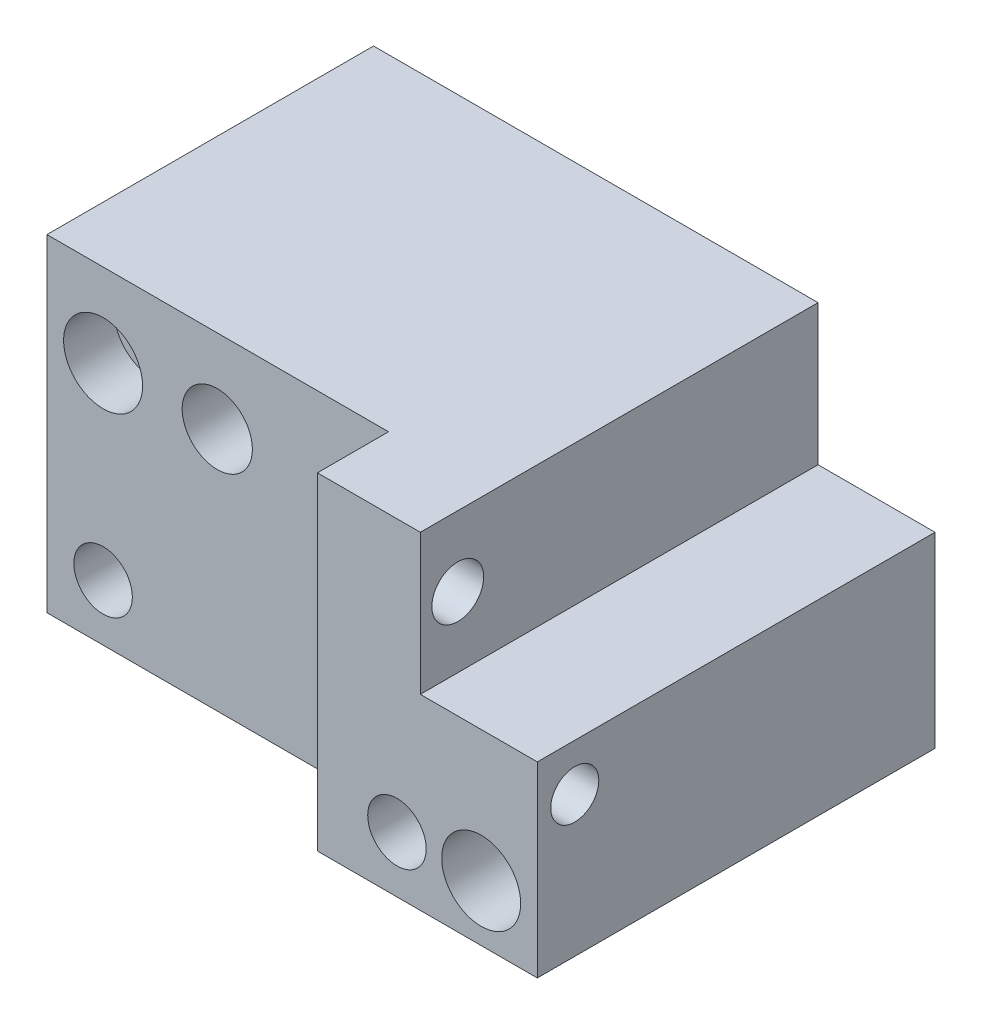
ISO-10303-21;
HEADER;
FILE_DESCRIPTION(('STEP AP214'),'2;1');
FILE_NAME('part.step','',(''),(''),'','','');
FILE_SCHEMA(('AUTOMOTIVE_DESIGN { 1 0 10303 214 1 1 1 1 }'));
ENDSEC;
DATA;
#1=APPLICATION_CONTEXT('core data for automotive mechanical design processes');
#2=APPLICATION_PROTOCOL_DEFINITION('international standard','automotive_design',2000,#1);
#3=PRODUCT_CONTEXT('',#1,'mechanical');
#4=PRODUCT('Part','Part','',(#3));
#5=PRODUCT_RELATED_PRODUCT_CATEGORY('part','',(#4));
#6=PRODUCT_DEFINITION_FORMATION('','',#4);
#7=PRODUCT_DEFINITION_CONTEXT('part definition',#1,'design');
#8=PRODUCT_DEFINITION('design','',#6,#7);
#9=PRODUCT_DEFINITION_SHAPE('','',#8);
#10=(LENGTH_UNIT() NAMED_UNIT(*) SI_UNIT(.MILLI.,.METRE.));
#11=(NAMED_UNIT(*) PLANE_ANGLE_UNIT() SI_UNIT($,.RADIAN.));
#12=(NAMED_UNIT(*) SI_UNIT($,.STERADIAN.) SOLID_ANGLE_UNIT());
#13=UNCERTAINTY_MEASURE_WITH_UNIT(LENGTH_MEASURE(1.E-05),#10,'distance_accuracy_value','');
#14=(GEOMETRIC_REPRESENTATION_CONTEXT(3) GLOBAL_UNCERTAINTY_ASSIGNED_CONTEXT((#13)) GLOBAL_UNIT_ASSIGNED_CONTEXT((#10,
#11,#12)) REPRESENTATION_CONTEXT('',''));
#15=CARTESIAN_POINT('',(0.,0.,0.));
#16=DIRECTION('',(0.,0.,1.));
#17=DIRECTION('',(1.,0.,0.));
#18=AXIS2_PLACEMENT_3D('',#15,#16,#17);
#19=CARTESIAN_POINT('',(0.,0.,-12.7));
#20=DIRECTION('',(0.,0.,-1.));
#21=DIRECTION('',(-1.,0.,0.));
#22=AXIS2_PLACEMENT_3D('',#19,#20,#21);
#23=PLANE('',#22);
#24=CARTESIAN_POINT('',(-146.05,78.74,-12.7));
#25=DIRECTION('',(0.,0.,-1.));
#26=DIRECTION('',(-1.,0.,0.));
#27=AXIS2_PLACEMENT_3D('',#24,#25,#26);
#28=CIRCLE('',#27,3.96875);
#29=CARTESIAN_POINT('',(-150.01875,78.74,-12.7));
#30=VERTEX_POINT('',#29);
#31=EDGE_CURVE('E157',#30,#30,#28,.T.);
#32=ORIENTED_EDGE('',*,*,#31,.F.);
#33=EDGE_LOOP('',(#32));
#34=FACE_BOUND('',#33,.T.);
#35=CARTESIAN_POINT('',(-195.58,78.74,-12.7));
#36=DIRECTION('',(0.,0.,-1.));
#37=DIRECTION('',(-1.,0.,0.));
#38=AXIS2_PLACEMENT_3D('',#35,#36,#37);
#39=CIRCLE('',#38,3.96875);
#40=CARTESIAN_POINT('',(-199.54875,78.74,-12.7));
#41=VERTEX_POINT('',#40);
#42=EDGE_CURVE('E161',#41,#41,#39,.T.);
#43=ORIENTED_EDGE('',*,*,#42,.F.);
#44=EDGE_LOOP('',(#43));
#45=FACE_BOUND('',#44,.T.);
#46=CARTESIAN_POINT('',(-195.58,104.267,-12.7));
#47=DIRECTION('',(0.,0.,-1.));
#48=DIRECTION('',(-1.,0.,0.));
#49=AXIS2_PLACEMENT_3D('',#46,#47,#48);
#50=CIRCLE('',#49,3.5687);
#51=CARTESIAN_POINT('',(-199.1487,104.267,-12.7));
#52=VERTEX_POINT('',#51);
#53=EDGE_CURVE('E167',#52,#52,#50,.F.);
#54=ORIENTED_EDGE('',*,*,#53,.T.);
#55=EDGE_LOOP('',(#54));
#56=FACE_BOUND('',#55,.T.);
#57=CARTESIAN_POINT('',(-180.086,104.267,-12.7));
#58=DIRECTION('',(0.,0.,-1.));
#59=DIRECTION('',(-1.,0.,0.));
#60=AXIS2_PLACEMENT_3D('',#57,#58,#59);
#61=CIRCLE('',#60,4.7625);
#62=CARTESIAN_POINT('',(-184.8485,104.267,-12.7));
#63=VERTEX_POINT('',#62);
#64=EDGE_CURVE('E173',#63,#63,#61,.F.);
#65=ORIENTED_EDGE('',*,*,#64,.T.);
#66=EDGE_LOOP('',(#65));
#67=FACE_BOUND('',#66,.T.);
#68=DIRECTION('',(1.,0.,0.));
#69=VECTOR('',#68,1.);
#70=CARTESIAN_POINT('',(-127.,96.52,-12.7));
#71=LINE('',#70,#69);
#72=CARTESIAN_POINT('',(-142.875,96.52,-12.7));
#73=VERTEX_POINT('',#72);
#74=CARTESIAN_POINT('',(-127.,96.52,-12.7));
#75=VERTEX_POINT('',#74);
#76=EDGE_CURVE('E65',#73,#75,#71,.T.);
#77=ORIENTED_EDGE('',*,*,#76,.T.);
#78=DIRECTION('',(0.,1.,0.));
#79=VECTOR('',#78,1.);
#80=CARTESIAN_POINT('',(-127.,0.,-12.7));
#81=LINE('',#80,#79);
#82=CARTESIAN_POINT('',(-127.,71.12,-12.7));
#83=VERTEX_POINT('',#82);
#84=EDGE_CURVE('E189',#83,#75,#81,.T.);
#85=ORIENTED_EDGE('',*,*,#84,.F.);
#86=DIRECTION('',(1.,0.,0.));
#87=VECTOR('',#86,1.);
#88=CARTESIAN_POINT('',(0.,71.12,-12.7));
#89=LINE('',#88,#87);
#90=CARTESIAN_POINT('',(-203.2,71.12,-12.7));
#91=VERTEX_POINT('',#90);
#92=EDGE_CURVE('E131',#91,#83,#89,.T.);
#93=ORIENTED_EDGE('',*,*,#92,.F.);
#94=DIRECTION('',(0.,-1.,0.));
#95=VECTOR('',#94,1.);
#96=CARTESIAN_POINT('',(-203.2,0.,-12.7));
#97=LINE('',#96,#95);
#98=CARTESIAN_POINT('',(-203.2,115.57,-12.7));
#99=VERTEX_POINT('',#98);
#100=EDGE_CURVE('E190',#99,#91,#97,.T.);
#101=ORIENTED_EDGE('',*,*,#100,.F.);
#102=DIRECTION('',(-1.,0.,0.));
#103=VECTOR('',#102,1.);
#104=CARTESIAN_POINT('',(0.,115.57,-12.7));
#105=LINE('',#104,#103);
#106=CARTESIAN_POINT('',(-142.875,115.57,-12.7));
#107=VERTEX_POINT('',#106);
#108=EDGE_CURVE('E126',#107,#99,#105,.T.);
#109=ORIENTED_EDGE('',*,*,#108,.F.);
#110=DIRECTION('',(0.,-1.,0.));
#111=VECTOR('',#110,1.);
#112=CARTESIAN_POINT('',(-142.875,115.57,-12.7));
#113=LINE('',#112,#111);
#114=EDGE_CURVE('E182',#107,#73,#113,.T.);
#115=ORIENTED_EDGE('',*,*,#114,.T.);
#116=EDGE_LOOP('',(#77,#85,#93,#101,#109,#115));
#117=FACE_BOUND('',#116,.T.);
#118=CARTESIAN_POINT('',(-134.62,78.74,-12.7));
#119=DIRECTION('',(0.,0.,-1.));
#120=DIRECTION('',(-1.,0.,0.));
#121=AXIS2_PLACEMENT_3D('',#118,#119,#120);
#122=CIRCLE('',#121,3.5687);
#123=CARTESIAN_POINT('',(-138.1887,78.74,-12.7));
#124=VERTEX_POINT('',#123);
#125=EDGE_CURVE('E199',#124,#124,#122,.F.);
#126=ORIENTED_EDGE('',*,*,#125,.T.);
#127=EDGE_LOOP('',(#126));
#128=FACE_BOUND('',#127,.T.);
#129=ADVANCED_FACE('F45',(#34,#45,#56,#67,#117,#128),#23,.T.);
#130=CARTESIAN_POINT('',(-203.2,71.12,41.275));
#131=DIRECTION('',(1.,0.,0.));
#132=DIRECTION('',(0.,0.,-1.));
#133=AXIS2_PLACEMENT_3D('',#130,#131,#132);
#134=PLANE('',#133);
#135=DIRECTION('',(0.,-1.,0.));
#136=VECTOR('',#135,1.);
#137=CARTESIAN_POINT('',(-203.2,71.12,31.623));
#138=LINE('',#137,#136);
#139=CARTESIAN_POINT('',(-203.2,115.57,31.623));
#140=VERTEX_POINT('',#139);
#141=CARTESIAN_POINT('',(-203.2,71.12,31.623));
#142=VERTEX_POINT('',#141);
#143=EDGE_CURVE('E101',#140,#142,#138,.T.);
#144=ORIENTED_EDGE('',*,*,#143,.F.);
#145=DIRECTION('',(0.,0.,-1.));
#146=VECTOR('',#145,1.);
#147=CARTESIAN_POINT('',(-203.2,115.57,41.275));
#148=LINE('',#147,#146);
#149=EDGE_CURVE('E136',#140,#99,#148,.T.);
#150=ORIENTED_EDGE('',*,*,#149,.T.);
#151=ORIENTED_EDGE('',*,*,#100,.T.);
#152=DIRECTION('',(0.,0.,-1.));
#153=VECTOR('',#152,1.);
#154=CARTESIAN_POINT('',(-203.2,71.12,41.275));
#155=LINE('',#154,#153);
#156=EDGE_CURVE('E12',#142,#91,#155,.T.);
#157=ORIENTED_EDGE('',*,*,#156,.F.);
#158=EDGE_LOOP('',(#144,#150,#151,#157));
#159=FACE_BOUND('',#158,.T.);
#160=ADVANCED_FACE('F290',(#159),#134,.F.);
#161=CARTESIAN_POINT('',(-203.2,71.12,41.275));
#162=DIRECTION('',(0.,1.,0.));
#163=DIRECTION('',(0.,0.,1.));
#164=AXIS2_PLACEMENT_3D('',#161,#162,#163);
#165=PLANE('',#164);
#166=DIRECTION('',(1.,0.,0.));
#167=VECTOR('',#166,1.);
#168=CARTESIAN_POINT('',(-203.2,71.12,41.275));
#169=LINE('',#168,#167);
#170=CARTESIAN_POINT('',(-156.845,71.12,41.275));
#171=VERTEX_POINT('',#170);
#172=CARTESIAN_POINT('',(-127.,71.12,41.275));
#173=VERTEX_POINT('',#172);
#174=EDGE_CURVE('E116',#171,#173,#169,.T.);
#175=ORIENTED_EDGE('',*,*,#174,.F.);
#176=DIRECTION('',(0.,0.,1.));
#177=VECTOR('',#176,1.);
#178=CARTESIAN_POINT('',(-156.845,71.12,31.75));
#179=LINE('',#178,#177);
#180=CARTESIAN_POINT('',(-156.845,71.12,31.623));
#181=VERTEX_POINT('',#180);
#182=EDGE_CURVE('E219',#181,#171,#179,.T.);
#183=ORIENTED_EDGE('',*,*,#182,.F.);
#184=DIRECTION('',(1.,0.,0.));
#185=VECTOR('',#184,1.);
#186=CARTESIAN_POINT('',(-203.2,71.12,31.623));
#187=LINE('',#186,#185);
#188=EDGE_CURVE('E49',#142,#181,#187,.T.);
#189=ORIENTED_EDGE('',*,*,#188,.F.);
#190=ORIENTED_EDGE('',*,*,#156,.T.);
#191=ORIENTED_EDGE('',*,*,#92,.T.);
#192=DIRECTION('',(0.,0.,-1.));
#193=VECTOR('',#192,1.);
#194=CARTESIAN_POINT('',(-127.,71.12,41.275));
#195=LINE('',#194,#193);
#196=EDGE_CURVE('E56',#173,#83,#195,.T.);
#197=ORIENTED_EDGE('',*,*,#196,.F.);
#198=EDGE_LOOP('',(#175,#183,#189,#190,#191,#197));
#199=FACE_BOUND('',#198,.T.);
#200=ADVANCED_FACE('F129',(#199),#165,.F.);
#201=CARTESIAN_POINT('',(-127.,71.12,41.275));
#202=DIRECTION('',(-1.,0.,0.));
#203=DIRECTION('',(0.,0.,1.));
#204=AXIS2_PLACEMENT_3D('',#201,#202,#203);
#205=PLANE('',#204);
#206=CARTESIAN_POINT('',(-127.,90.17,36.195));
#207=DIRECTION('',(1.,0.,0.));
#208=DIRECTION('',(0.,0.,-1.));
#209=AXIS2_PLACEMENT_3D('',#206,#207,#208);
#210=CIRCLE('',#209,3.2639);
#211=CARTESIAN_POINT('',(-127.,90.17,32.9311));
#212=VERTEX_POINT('',#211);
#213=EDGE_CURVE('E156',#212,#212,#210,.T.);
#214=ORIENTED_EDGE('',*,*,#213,.F.);
#215=EDGE_LOOP('',(#214));
#216=FACE_BOUND('',#215,.T.);
#217=ORIENTED_EDGE('',*,*,#84,.T.);
#218=DIRECTION('',(0.,0.,1.));
#219=VECTOR('',#218,1.);
#220=CARTESIAN_POINT('',(-127.,96.52,0.));
#221=LINE('',#220,#219);
#222=CARTESIAN_POINT('',(-127.,96.52,41.275));
#223=VERTEX_POINT('',#222);
#224=EDGE_CURVE('E140',#75,#223,#221,.T.);
#225=ORIENTED_EDGE('',*,*,#224,.T.);
#226=DIRECTION('',(0.,1.,0.));
#227=VECTOR('',#226,1.);
#228=CARTESIAN_POINT('',(-127.,71.12,41.275));
#229=LINE('',#228,#227);
#230=EDGE_CURVE('E121',#173,#223,#229,.T.);
#231=ORIENTED_EDGE('',*,*,#230,.F.);
#232=ORIENTED_EDGE('',*,*,#196,.T.);
#233=EDGE_LOOP('',(#217,#225,#231,#232));
#234=FACE_BOUND('',#233,.T.);
#235=ADVANCED_FACE('F139',(#216,#234),#205,.F.);
#236=CARTESIAN_POINT('',(-203.2,115.57,41.275));
#237=DIRECTION('',(0.,-1.,0.));
#238=DIRECTION('',(0.,0.,-1.));
#239=AXIS2_PLACEMENT_3D('',#236,#237,#238);
#240=PLANE('',#239);
#241=DIRECTION('',(-1.,0.,0.));
#242=VECTOR('',#241,1.);
#243=CARTESIAN_POINT('',(-203.2,115.57,41.275));
#244=LINE('',#243,#242);
#245=CARTESIAN_POINT('',(-142.875,115.57,41.275));
#246=VERTEX_POINT('',#245);
#247=CARTESIAN_POINT('',(-156.845,115.57,41.275));
#248=VERTEX_POINT('',#247);
#249=EDGE_CURVE('E109',#246,#248,#244,.T.);
#250=ORIENTED_EDGE('',*,*,#249,.F.);
#251=DIRECTION('',(0.,0.,1.));
#252=VECTOR('',#251,1.);
#253=CARTESIAN_POINT('',(-142.875,115.57,0.));
#254=LINE('',#253,#252);
#255=EDGE_CURVE('E181',#107,#246,#254,.T.);
#256=ORIENTED_EDGE('',*,*,#255,.F.);
#257=ORIENTED_EDGE('',*,*,#108,.T.);
#258=ORIENTED_EDGE('',*,*,#149,.F.);
#259=DIRECTION('',(-1.,0.,0.));
#260=VECTOR('',#259,1.);
#261=CARTESIAN_POINT('',(-203.2,115.57,31.623));
#262=LINE('',#261,#260);
#263=CARTESIAN_POINT('',(-156.845,115.57,31.623));
#264=VERTEX_POINT('',#263);
#265=EDGE_CURVE('E217',#264,#140,#262,.T.);
#266=ORIENTED_EDGE('',*,*,#265,.F.);
#267=DIRECTION('',(0.,0.,1.));
#268=VECTOR('',#267,1.);
#269=CARTESIAN_POINT('',(-156.845,115.57,31.75));
#270=LINE('',#269,#268);
#271=EDGE_CURVE('E194',#264,#248,#270,.T.);
#272=ORIENTED_EDGE('',*,*,#271,.T.);
#273=EDGE_LOOP('',(#250,#256,#257,#258,#266,#272));
#274=FACE_BOUND('',#273,.T.);
#275=ADVANCED_FACE('F320',(#274),#240,.F.);
#276=CARTESIAN_POINT('',(0.,0.,41.275));
#277=DIRECTION('',(0.,0.,-1.));
#278=DIRECTION('',(-1.,0.,0.));
#279=AXIS2_PLACEMENT_3D('',#276,#277,#278);
#280=PLANE('',#279);
#281=CARTESIAN_POINT('',(-146.05,78.74,41.275));
#282=DIRECTION('',(0.,0.,-1.));
#283=DIRECTION('',(-1.,0.,0.));
#284=AXIS2_PLACEMENT_3D('',#281,#282,#283);
#285=CIRCLE('',#284,3.96875);
#286=CARTESIAN_POINT('',(-150.01875,78.74,41.275));
#287=VERTEX_POINT('',#286);
#288=EDGE_CURVE('E162',#287,#287,#285,.T.);
#289=ORIENTED_EDGE('',*,*,#288,.T.);
#290=EDGE_LOOP('',(#289));
#291=FACE_BOUND('',#290,.T.);
#292=CARTESIAN_POINT('',(-134.62,78.74,41.275));
#293=DIRECTION('',(0.,0.,1.));
#294=DIRECTION('',(1.,0.,0.));
#295=AXIS2_PLACEMENT_3D('',#292,#293,#294);
#296=CIRCLE('',#295,5.3594);
#297=CARTESIAN_POINT('',(-129.2606,78.74,41.275));
#298=VERTEX_POINT('',#297);
#299=EDGE_CURVE('E172',#298,#298,#296,.T.);
#300=ORIENTED_EDGE('',*,*,#299,.F.);
#301=EDGE_LOOP('',(#300));
#302=FACE_BOUND('',#301,.T.);
#303=ORIENTED_EDGE('',*,*,#230,.T.);
#304=DIRECTION('',(1.,0.,0.));
#305=VECTOR('',#304,1.);
#306=CARTESIAN_POINT('',(-127.,96.52,41.275));
#307=LINE('',#306,#305);
#308=CARTESIAN_POINT('',(-142.875,96.52,41.275));
#309=VERTEX_POINT('',#308);
#310=EDGE_CURVE('E186',#309,#223,#307,.T.);
#311=ORIENTED_EDGE('',*,*,#310,.F.);
#312=DIRECTION('',(0.,-1.,0.));
#313=VECTOR('',#312,1.);
#314=CARTESIAN_POINT('',(-142.875,115.57,41.275));
#315=LINE('',#314,#313);
#316=EDGE_CURVE('E155',#246,#309,#315,.T.);
#317=ORIENTED_EDGE('',*,*,#316,.F.);
#318=ORIENTED_EDGE('',*,*,#249,.T.);
#319=DIRECTION('',(0.,1.,0.));
#320=VECTOR('',#319,1.);
#321=CARTESIAN_POINT('',(-156.845,115.57,41.275));
#322=LINE('',#321,#320);
#323=EDGE_CURVE('E122',#171,#248,#322,.T.);
#324=ORIENTED_EDGE('',*,*,#323,.F.);
#325=ORIENTED_EDGE('',*,*,#174,.T.);
#326=EDGE_LOOP('',(#303,#311,#317,#318,#324,#325));
#327=FACE_BOUND('',#326,.T.);
#328=ADVANCED_FACE('F118',(#291,#302,#327),#280,.F.);
#329=CARTESIAN_POINT('',(-156.845,115.57,31.75));
#330=DIRECTION('',(1.,0.,0.));
#331=DIRECTION('',(0.,1.,0.));
#332=AXIS2_PLACEMENT_3D('',#329,#330,#331);
#333=PLANE('',#332);
#334=CARTESIAN_POINT('',(-156.845,106.045,36.195));
#335=DIRECTION('',(1.,0.,0.));
#336=DIRECTION('',(0.,1.,0.));
#337=AXIS2_PLACEMENT_3D('',#334,#335,#336);
#338=CIRCLE('',#337,3.5179);
#339=CARTESIAN_POINT('',(-156.845,109.5629,36.195));
#340=VERTEX_POINT('',#339);
#341=EDGE_CURVE('E251',#340,#340,#338,.T.);
#342=ORIENTED_EDGE('',*,*,#341,.T.);
#343=EDGE_LOOP('',(#342));
#344=FACE_BOUND('',#343,.T.);
#345=CARTESIAN_POINT('',(-156.845,90.17,36.195));
#346=DIRECTION('',(1.,0.,0.));
#347=DIRECTION('',(0.,1.,0.));
#348=AXIS2_PLACEMENT_3D('',#345,#346,#347);
#349=CIRCLE('',#348,3.2639);
#350=CARTESIAN_POINT('',(-156.845,93.4339,36.195));
#351=VERTEX_POINT('',#350);
#352=EDGE_CURVE('E151',#351,#351,#349,.T.);
#353=ORIENTED_EDGE('',*,*,#352,.T.);
#354=EDGE_LOOP('',(#353));
#355=FACE_BOUND('',#354,.T.);
#356=ORIENTED_EDGE('',*,*,#323,.T.);
#357=ORIENTED_EDGE('',*,*,#271,.F.);
#358=DIRECTION('',(0.,1.,0.));
#359=VECTOR('',#358,1.);
#360=CARTESIAN_POINT('',(-156.845,0.,31.623));
#361=LINE('',#360,#359);
#362=EDGE_CURVE('E96',#181,#264,#361,.T.);
#363=ORIENTED_EDGE('',*,*,#362,.F.);
#364=ORIENTED_EDGE('',*,*,#182,.T.);
#365=EDGE_LOOP('',(#356,#357,#363,#364));
#366=FACE_BOUND('',#365,.T.);
#367=ADVANCED_FACE('F319',(#344,#355,#366),#333,.F.);
#368=CARTESIAN_POINT('',(0.,0.,31.623));
#369=DIRECTION('',(0.,0.,1.));
#370=DIRECTION('',(1.,0.,0.));
#371=AXIS2_PLACEMENT_3D('',#368,#369,#370);
#372=PLANE('',#371);
#373=CARTESIAN_POINT('',(-195.58,78.74,31.623));
#374=DIRECTION('',(0.,0.,1.));
#375=DIRECTION('',(1.,0.,0.));
#376=AXIS2_PLACEMENT_3D('',#373,#374,#375);
#377=CIRCLE('',#376,3.96875);
#378=CARTESIAN_POINT('',(-191.61125,78.74,31.623));
#379=VERTEX_POINT('',#378);
#380=EDGE_CURVE('E166',#379,#379,#377,.T.);
#381=ORIENTED_EDGE('',*,*,#380,.F.);
#382=EDGE_LOOP('',(#381));
#383=FACE_BOUND('',#382,.T.);
#384=CARTESIAN_POINT('',(-195.58,104.267,31.623));
#385=DIRECTION('',(0.,0.,1.));
#386=DIRECTION('',(1.,0.,0.));
#387=AXIS2_PLACEMENT_3D('',#384,#385,#386);
#388=CIRCLE('',#387,5.3594);
#389=CARTESIAN_POINT('',(-190.2206,104.267,31.623));
#390=VERTEX_POINT('',#389);
#391=EDGE_CURVE('E178',#390,#390,#388,.T.);
#392=ORIENTED_EDGE('',*,*,#391,.F.);
#393=EDGE_LOOP('',(#392));
#394=FACE_BOUND('',#393,.T.);
#395=CARTESIAN_POINT('',(-180.086,104.267,31.623));
#396=DIRECTION('',(0.,0.,1.));
#397=DIRECTION('',(1.,0.,0.));
#398=AXIS2_PLACEMENT_3D('',#395,#396,#397);
#399=CIRCLE('',#398,4.7625);
#400=CARTESIAN_POINT('',(-175.3235,104.267,31.623));
#401=VERTEX_POINT('',#400);
#402=EDGE_CURVE('E177',#401,#401,#399,.T.);
#403=ORIENTED_EDGE('',*,*,#402,.F.);
#404=EDGE_LOOP('',(#403));
#405=FACE_BOUND('',#404,.T.);
#406=ORIENTED_EDGE('',*,*,#143,.T.);
#407=ORIENTED_EDGE('',*,*,#188,.T.);
#408=ORIENTED_EDGE('',*,*,#362,.T.);
#409=ORIENTED_EDGE('',*,*,#265,.T.);
#410=EDGE_LOOP('',(#406,#407,#408,#409));
#411=FACE_BOUND('',#410,.T.);
#412=ADVANCED_FACE('F47',(#383,#394,#405,#411),#372,.T.);
#413=CARTESIAN_POINT('',(-127.,96.52,0.));
#414=DIRECTION('',(0.,-1.,0.));
#415=DIRECTION('',(0.,0.,-1.));
#416=AXIS2_PLACEMENT_3D('',#413,#414,#415);
#417=PLANE('',#416);
#418=ORIENTED_EDGE('',*,*,#310,.T.);
#419=ORIENTED_EDGE('',*,*,#224,.F.);
#420=ORIENTED_EDGE('',*,*,#76,.F.);
#421=DIRECTION('',(0.,0.,1.));
#422=VECTOR('',#421,1.);
#423=CARTESIAN_POINT('',(-142.875,96.52,0.));
#424=LINE('',#423,#422);
#425=EDGE_CURVE('E237',#73,#309,#424,.T.);
#426=ORIENTED_EDGE('',*,*,#425,.T.);
#427=EDGE_LOOP('',(#418,#419,#420,#426));
#428=FACE_BOUND('',#427,.T.);
#429=ADVANCED_FACE('F349',(#428),#417,.F.);
#430=CARTESIAN_POINT('',(-142.875,115.57,0.));
#431=DIRECTION('',(-1.,0.,0.));
#432=DIRECTION('',(0.,0.,1.));
#433=AXIS2_PLACEMENT_3D('',#430,#431,#432);
#434=PLANE('',#433);
#435=CARTESIAN_POINT('',(-142.875,106.045,36.195));
#436=DIRECTION('',(1.,0.,0.));
#437=DIRECTION('',(0.,0.,-1.));
#438=AXIS2_PLACEMENT_3D('',#435,#436,#437);
#439=CIRCLE('',#438,3.5179);
#440=CARTESIAN_POINT('',(-142.875,106.045,32.6771));
#441=VERTEX_POINT('',#440);
#442=EDGE_CURVE('E214',#441,#441,#439,.T.);
#443=ORIENTED_EDGE('',*,*,#442,.F.);
#444=EDGE_LOOP('',(#443));
#445=FACE_BOUND('',#444,.T.);
#446=ORIENTED_EDGE('',*,*,#316,.T.);
#447=ORIENTED_EDGE('',*,*,#425,.F.);
#448=ORIENTED_EDGE('',*,*,#114,.F.);
#449=ORIENTED_EDGE('',*,*,#255,.T.);
#450=EDGE_LOOP('',(#446,#447,#448,#449));
#451=FACE_BOUND('',#450,.T.);
#452=ADVANCED_FACE('F346',(#445,#451),#434,.F.);
#453=CARTESIAN_POINT('',(-127.,90.17,36.195));
#454=DIRECTION('',(1.,0.,0.));
#455=DIRECTION('',(0.,0.,-1.));
#456=AXIS2_PLACEMENT_3D('',#453,#454,#455);
#457=CYLINDRICAL_SURFACE('',#456,3.2639);
#458=ORIENTED_EDGE('',*,*,#213,.T.);
#459=EDGE_LOOP('',(#458));
#460=FACE_BOUND('',#459,.T.);
#461=ORIENTED_EDGE('',*,*,#352,.F.);
#462=EDGE_LOOP('',(#461));
#463=FACE_BOUND('',#462,.T.);
#464=ADVANCED_FACE('F357',(#460,#463),#457,.F.);
#465=CARTESIAN_POINT('',(-142.875,106.045,36.195));
#466=DIRECTION('',(1.,0.,0.));
#467=DIRECTION('',(0.,0.,-1.));
#468=AXIS2_PLACEMENT_3D('',#465,#466,#467);
#469=CYLINDRICAL_SURFACE('',#468,3.5179);
#470=ORIENTED_EDGE('',*,*,#442,.T.);
#471=EDGE_LOOP('',(#470));
#472=FACE_BOUND('',#471,.T.);
#473=ORIENTED_EDGE('',*,*,#341,.F.);
#474=EDGE_LOOP('',(#473));
#475=FACE_BOUND('',#474,.T.);
#476=ADVANCED_FACE('F363',(#472,#475),#469,.F.);
#477=CARTESIAN_POINT('',(-180.086,104.267,31.75));
#478=DIRECTION('',(0.,0.,1.));
#479=DIRECTION('',(1.,0.,0.));
#480=AXIS2_PLACEMENT_3D('',#477,#478,#479);
#481=CYLINDRICAL_SURFACE('',#480,4.7625);
#482=ORIENTED_EDGE('',*,*,#64,.F.);
#483=EDGE_LOOP('',(#482));
#484=FACE_BOUND('',#483,.T.);
#485=ORIENTED_EDGE('',*,*,#402,.T.);
#486=EDGE_LOOP('',(#485));
#487=FACE_BOUND('',#486,.T.);
#488=ADVANCED_FACE('F367',(#484,#487),#481,.F.);
#489=CARTESIAN_POINT('',(-195.58,104.267,41.275));
#490=DIRECTION('',(0.,0.,1.));
#491=DIRECTION('',(1.,0.,0.));
#492=AXIS2_PLACEMENT_3D('',#489,#490,#491);
#493=CYLINDRICAL_SURFACE('',#492,5.3594);
#494=ORIENTED_EDGE('',*,*,#391,.T.);
#495=EDGE_LOOP('',(#494));
#496=FACE_BOUND('',#495,.T.);
#497=CARTESIAN_POINT('',(-195.58,104.267,24.765));
#498=DIRECTION('',(0.,0.,1.));
#499=DIRECTION('',(1.,0.,0.));
#500=AXIS2_PLACEMENT_3D('',#497,#498,#499);
#501=CIRCLE('',#500,5.3594);
#502=CARTESIAN_POINT('',(-190.2206,104.267,24.765));
#503=VERTEX_POINT('',#502);
#504=EDGE_CURVE('E210',#503,#503,#501,.T.);
#505=ORIENTED_EDGE('',*,*,#504,.F.);
#506=EDGE_LOOP('',(#505));
#507=FACE_BOUND('',#506,.T.);
#508=ADVANCED_FACE('F371',(#496,#507),#493,.F.);
#509=CARTESIAN_POINT('',(-192.0113,104.267,24.765));
#510=DIRECTION('',(0.,0.,-1.));
#511=DIRECTION('',(-1.,0.,0.));
#512=AXIS2_PLACEMENT_3D('',#509,#510,#511);
#513=PLANE('',#512);
#514=CARTESIAN_POINT('',(-195.58,104.267,24.765));
#515=DIRECTION('',(0.,0.,1.));
#516=DIRECTION('',(1.,0.,0.));
#517=AXIS2_PLACEMENT_3D('',#514,#515,#516);
#518=CIRCLE('',#517,3.5687);
#519=CARTESIAN_POINT('',(-192.0113,104.267,24.765));
#520=VERTEX_POINT('',#519);
#521=EDGE_CURVE('E171',#520,#520,#518,.T.);
#522=ORIENTED_EDGE('',*,*,#521,.F.);
#523=EDGE_LOOP('',(#522));
#524=FACE_BOUND('',#523,.T.);
#525=ORIENTED_EDGE('',*,*,#504,.T.);
#526=EDGE_LOOP('',(#525));
#527=FACE_BOUND('',#526,.T.);
#528=ADVANCED_FACE('F375',(#524,#527),#513,.F.);
#529=CARTESIAN_POINT('',(-195.58,104.267,41.275));
#530=DIRECTION('',(0.,0.,1.));
#531=DIRECTION('',(1.,0.,0.));
#532=AXIS2_PLACEMENT_3D('',#529,#530,#531);
#533=CYLINDRICAL_SURFACE('',#532,3.5687);
#534=ORIENTED_EDGE('',*,*,#53,.F.);
#535=EDGE_LOOP('',(#534));
#536=FACE_BOUND('',#535,.T.);
#537=ORIENTED_EDGE('',*,*,#521,.T.);
#538=EDGE_LOOP('',(#537));
#539=FACE_BOUND('',#538,.T.);
#540=ADVANCED_FACE('F315',(#536,#539),#533,.F.);
#541=CARTESIAN_POINT('',(-134.62,78.74,41.275));
#542=DIRECTION('',(0.,0.,1.));
#543=DIRECTION('',(1.,0.,0.));
#544=AXIS2_PLACEMENT_3D('',#541,#542,#543);
#545=CYLINDRICAL_SURFACE('',#544,5.3594);
#546=CARTESIAN_POINT('',(-134.62,78.74,24.765));
#547=DIRECTION('',(0.,0.,1.));
#548=DIRECTION('',(1.,0.,0.));
#549=AXIS2_PLACEMENT_3D('',#546,#547,#548);
#550=CIRCLE('',#549,5.3594);
#551=CARTESIAN_POINT('',(-129.2606,78.74,24.765));
#552=VERTEX_POINT('',#551);
#553=EDGE_CURVE('E267',#552,#552,#550,.T.);
#554=ORIENTED_EDGE('',*,*,#553,.F.);
#555=EDGE_LOOP('',(#554));
#556=FACE_BOUND('',#555,.T.);
#557=ORIENTED_EDGE('',*,*,#299,.T.);
#558=EDGE_LOOP('',(#557));
#559=FACE_BOUND('',#558,.T.);
#560=ADVANCED_FACE('F309',(#556,#559),#545,.F.);
#561=CARTESIAN_POINT('',(-131.0513,78.74,24.765));
#562=DIRECTION('',(0.,0.,-1.));
#563=DIRECTION('',(-1.,0.,0.));
#564=AXIS2_PLACEMENT_3D('',#561,#562,#563);
#565=PLANE('',#564);
#566=CARTESIAN_POINT('',(-134.62,78.74,24.765));
#567=DIRECTION('',(0.,0.,1.));
#568=DIRECTION('',(1.,0.,0.));
#569=AXIS2_PLACEMENT_3D('',#566,#567,#568);
#570=CIRCLE('',#569,3.5687);
#571=CARTESIAN_POINT('',(-131.0513,78.74,24.765));
#572=VERTEX_POINT('',#571);
#573=EDGE_CURVE('E203',#572,#572,#570,.T.);
#574=ORIENTED_EDGE('',*,*,#573,.F.);
#575=EDGE_LOOP('',(#574));
#576=FACE_BOUND('',#575,.T.);
#577=ORIENTED_EDGE('',*,*,#553,.T.);
#578=EDGE_LOOP('',(#577));
#579=FACE_BOUND('',#578,.T.);
#580=ADVANCED_FACE('F303',(#576,#579),#565,.F.);
#581=CARTESIAN_POINT('',(-134.62,78.74,41.275));
#582=DIRECTION('',(0.,0.,1.));
#583=DIRECTION('',(1.,0.,0.));
#584=AXIS2_PLACEMENT_3D('',#581,#582,#583);
#585=CYLINDRICAL_SURFACE('',#584,3.5687);
#586=ORIENTED_EDGE('',*,*,#125,.F.);
#587=EDGE_LOOP('',(#586));
#588=FACE_BOUND('',#587,.T.);
#589=ORIENTED_EDGE('',*,*,#573,.T.);
#590=EDGE_LOOP('',(#589));
#591=FACE_BOUND('',#590,.T.);
#592=ADVANCED_FACE('F300',(#588,#591),#585,.F.);
#593=CARTESIAN_POINT('',(-195.58,78.74,0.));
#594=DIRECTION('',(0.,0.,-1.));
#595=DIRECTION('',(-1.,0.,0.));
#596=AXIS2_PLACEMENT_3D('',#593,#594,#595);
#597=CYLINDRICAL_SURFACE('',#596,3.96875);
#598=ORIENTED_EDGE('',*,*,#380,.T.);
#599=EDGE_LOOP('',(#598));
#600=FACE_BOUND('',#599,.T.);
#601=ORIENTED_EDGE('',*,*,#42,.T.);
#602=EDGE_LOOP('',(#601));
#603=FACE_BOUND('',#602,.T.);
#604=ADVANCED_FACE('F284',(#600,#603),#597,.F.);
#605=CARTESIAN_POINT('',(-146.05,78.74,0.));
#606=DIRECTION('',(0.,0.,-1.));
#607=DIRECTION('',(-1.,0.,0.));
#608=AXIS2_PLACEMENT_3D('',#605,#606,#607);
#609=CYLINDRICAL_SURFACE('',#608,3.96875);
#610=ORIENTED_EDGE('',*,*,#288,.F.);
#611=EDGE_LOOP('',(#610));
#612=FACE_BOUND('',#611,.T.);
#613=ORIENTED_EDGE('',*,*,#31,.T.);
#614=EDGE_LOOP('',(#613));
#615=FACE_BOUND('',#614,.T.);
#616=ADVANCED_FACE('F281',(#612,#615),#609,.F.);
#617=CLOSED_SHELL('',(#129,#160,#200,#235,#275,#328,#367,#412,#429,#452,#464,#476,#488,#508,
#528,#540,#560,#580,#592,#604,#616));
#618=MANIFOLD_SOLID_BREP('B2',#617);
#619=ADVANCED_BREP_SHAPE_REPRESENTATION('',(#18,#618),#14);
#620=SHAPE_DEFINITION_REPRESENTATION(#9,#619);
ENDSEC;
END-ISO-10303-21;
